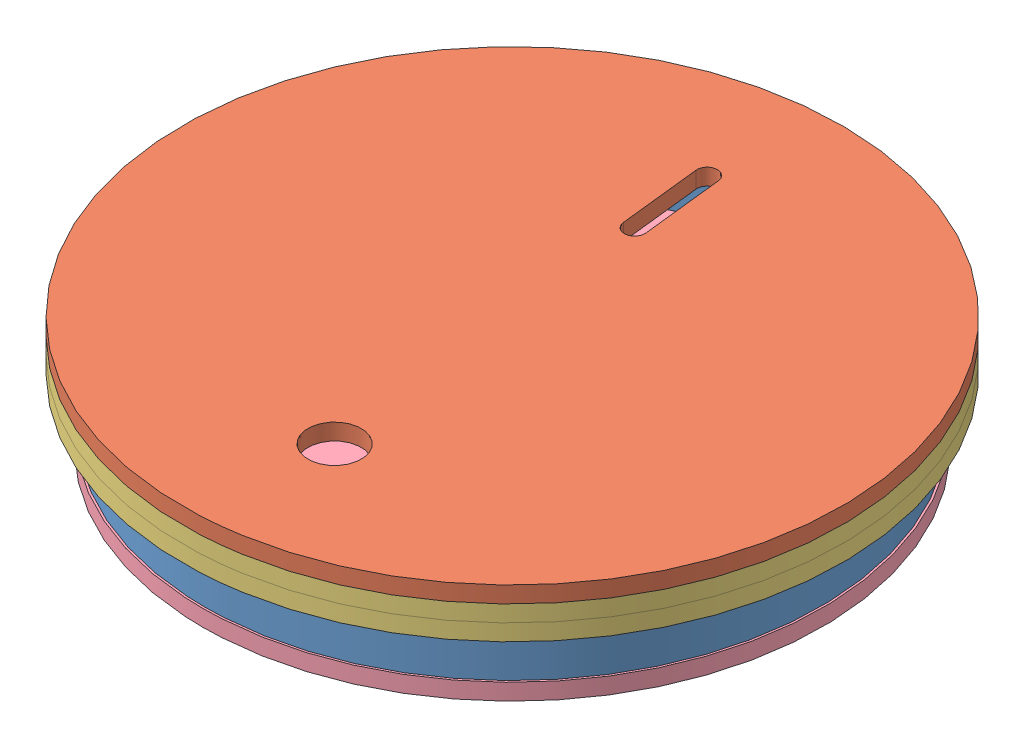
SolidWorks assembly Assem.main.SLDASM, configuration Default (file format 11000). Lengths in mm.
Overall size (177.43 28 177.43).
7 component instances, 4 part files, 3 mates.
Components (placement in the parent):
- ring-1: ring.SLDPRT [Default] at (83.9146 70.3164 -2.6279) size (150 10 150)
- ring-2: ring.SLDPRT [Default] at (83.9146 80.3164 -2.6279) size (150 10 150)
- Assem1-1: Assem1.SLDASM [Default] at (132.0558 164.666 -127.3191) x (-0.993997 0 0.109409) z (0.109409 0 0.993997) size (160.8 12 160.8)
  - cover-1: cover.SLDPRT [Default] at (61.4945 70.3496 118.6756) size (160.8 4 160.8)
  - ring.cover-1: ring.cover.SLDPRT [Default] at (61.4945 74.3496 118.6756) size (160.8 4 160.8)
  - ring.cover-2: ring.cover.SLDPRT [Default] at (61.4945 78.3496 118.6756) size (160.8 4 160.8)
- casing-2: casing.SLDPRT [Default] at (83.9146 66.3164 -2.6279) size (151 4 151)
Mates (geometry in assembly coordinates):
- Coincident3: coincident: circle of ring-2; plane of Assem1-1/cover-1 through (83.9146 90.3164 -2.6279) normal (0 -1 0)
- Concentric7: concentric: circle of ring-2; circle of Assem1-1/ring.cover-2
- Concentric8: concentric: cylinder of ring-1 through (83.9146 80.3164 -2.6279) axis (0 -1 0) radius 75; cylinder of casing-2 through (83.9146 70.3164 -2.6279) axis (0 -1 0) radius 75.5
